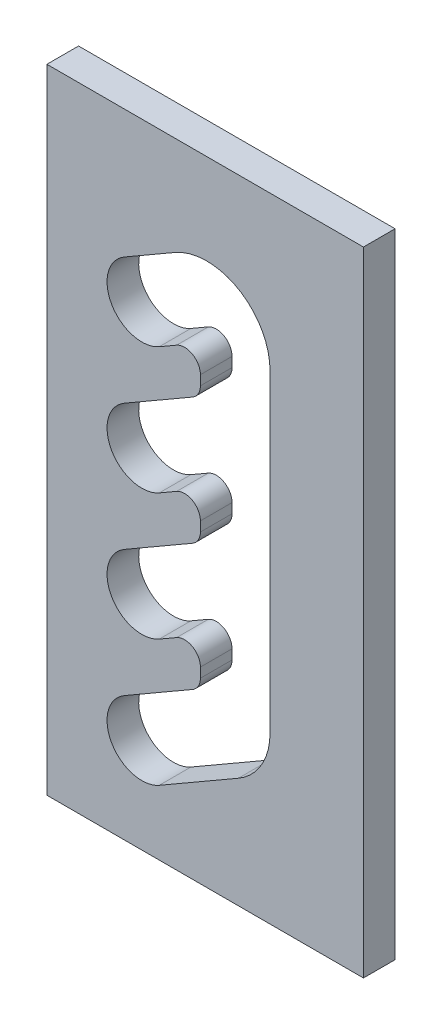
ISO-10303-21;
HEADER;
FILE_DESCRIPTION(('STEP AP214'),'2;1');
FILE_NAME('part.step','',(''),(''),'','','');
FILE_SCHEMA(('AUTOMOTIVE_DESIGN { 1 0 10303 214 1 1 1 1 }'));
ENDSEC;
DATA;
#1=APPLICATION_CONTEXT('core data for automotive mechanical design processes');
#2=APPLICATION_PROTOCOL_DEFINITION('international standard','automotive_design',2000,#1);
#3=PRODUCT_CONTEXT('',#1,'mechanical');
#4=PRODUCT('Part','Part','',(#3));
#5=PRODUCT_RELATED_PRODUCT_CATEGORY('part','',(#4));
#6=PRODUCT_DEFINITION_FORMATION('','',#4);
#7=PRODUCT_DEFINITION_CONTEXT('part definition',#1,'design');
#8=PRODUCT_DEFINITION('design','',#6,#7);
#9=PRODUCT_DEFINITION_SHAPE('','',#8);
#10=(LENGTH_UNIT() NAMED_UNIT(*) SI_UNIT(.MILLI.,.METRE.));
#11=(NAMED_UNIT(*) PLANE_ANGLE_UNIT() SI_UNIT($,.RADIAN.));
#12=(NAMED_UNIT(*) SI_UNIT($,.STERADIAN.) SOLID_ANGLE_UNIT());
#13=UNCERTAINTY_MEASURE_WITH_UNIT(LENGTH_MEASURE(1.E-05),#10,'distance_accuracy_value','');
#14=(GEOMETRIC_REPRESENTATION_CONTEXT(3) GLOBAL_UNCERTAINTY_ASSIGNED_CONTEXT((#13)) GLOBAL_UNIT_ASSIGNED_CONTEXT((#10,
#11,#12)) REPRESENTATION_CONTEXT('',''));
#15=CARTESIAN_POINT('',(0.,0.,0.));
#16=DIRECTION('',(0.,0.,1.));
#17=DIRECTION('',(1.,0.,0.));
#18=AXIS2_PLACEMENT_3D('',#15,#16,#17);
#19=CARTESIAN_POINT('',(0.,0.,10.));
#20=DIRECTION('',(1.,0.,0.));
#21=DIRECTION('',(0.,0.,-1.));
#22=AXIS2_PLACEMENT_3D('',#19,#20,#21);
#23=PLANE('',#22);
#24=DIRECTION('',(0.,-1.,0.));
#25=VECTOR('',#24,1.);
#26=CARTESIAN_POINT('',(0.,0.,0.));
#27=LINE('',#26,#25);
#28=CARTESIAN_POINT('',(0.,200.,0.));
#29=VERTEX_POINT('',#28);
#30=CARTESIAN_POINT('',(0.,0.,0.));
#31=VERTEX_POINT('',#30);
#32=EDGE_CURVE('E322',#29,#31,#27,.T.);
#33=ORIENTED_EDGE('',*,*,#32,.T.);
#34=DIRECTION('',(0.,0.,-1.));
#35=VECTOR('',#34,1.);
#36=CARTESIAN_POINT('',(0.,0.,10.));
#37=LINE('',#36,#35);
#38=CARTESIAN_POINT('',(0.,0.,10.));
#39=VERTEX_POINT('',#38);
#40=EDGE_CURVE('E363',#39,#31,#37,.T.);
#41=ORIENTED_EDGE('',*,*,#40,.F.);
#42=DIRECTION('',(0.,-1.,0.));
#43=VECTOR('',#42,1.);
#44=CARTESIAN_POINT('',(0.,0.,10.));
#45=LINE('',#44,#43);
#46=CARTESIAN_POINT('',(0.,200.,10.));
#47=VERTEX_POINT('',#46);
#48=EDGE_CURVE('E337',#47,#39,#45,.T.);
#49=ORIENTED_EDGE('',*,*,#48,.F.);
#50=DIRECTION('',(0.,0.,-1.));
#51=VECTOR('',#50,1.);
#52=CARTESIAN_POINT('',(0.,200.,10.));
#53=LINE('',#52,#51);
#54=EDGE_CURVE('E347',#47,#29,#53,.T.);
#55=ORIENTED_EDGE('',*,*,#54,.T.);
#56=EDGE_LOOP('',(#33,#41,#49,#55));
#57=FACE_BOUND('',#56,.T.);
#58=ADVANCED_FACE('F32',(#57),#23,.F.);
#59=CARTESIAN_POINT('',(0.,0.,10.));
#60=DIRECTION('',(0.,1.,0.));
#61=DIRECTION('',(0.,0.,1.));
#62=AXIS2_PLACEMENT_3D('',#59,#60,#61);
#63=PLANE('',#62);
#64=DIRECTION('',(1.,0.,0.));
#65=VECTOR('',#64,1.);
#66=CARTESIAN_POINT('',(0.,0.,0.));
#67=LINE('',#66,#65);
#68=CARTESIAN_POINT('',(100.,0.,0.));
#69=VERTEX_POINT('',#68);
#70=EDGE_CURVE('E350',#31,#69,#67,.T.);
#71=ORIENTED_EDGE('',*,*,#70,.T.);
#72=DIRECTION('',(0.,0.,-1.));
#73=VECTOR('',#72,1.);
#74=CARTESIAN_POINT('',(100.,0.,10.));
#75=LINE('',#74,#73);
#76=CARTESIAN_POINT('',(100.,0.,10.));
#77=VERTEX_POINT('',#76);
#78=EDGE_CURVE('E360',#77,#69,#75,.T.);
#79=ORIENTED_EDGE('',*,*,#78,.F.);
#80=DIRECTION('',(1.,0.,0.));
#81=VECTOR('',#80,1.);
#82=CARTESIAN_POINT('',(0.,0.,10.));
#83=LINE('',#82,#81);
#84=EDGE_CURVE('E340',#39,#77,#83,.T.);
#85=ORIENTED_EDGE('',*,*,#84,.F.);
#86=ORIENTED_EDGE('',*,*,#40,.T.);
#87=EDGE_LOOP('',(#71,#79,#85,#86));
#88=FACE_BOUND('',#87,.T.);
#89=ADVANCED_FACE('F530',(#88),#63,.F.);
#90=CARTESIAN_POINT('',(100.,0.,10.));
#91=DIRECTION('',(-1.,0.,0.));
#92=DIRECTION('',(0.,0.,1.));
#93=AXIS2_PLACEMENT_3D('',#90,#91,#92);
#94=PLANE('',#93);
#95=DIRECTION('',(0.,1.,0.));
#96=VECTOR('',#95,1.);
#97=CARTESIAN_POINT('',(100.,0.,0.));
#98=LINE('',#97,#96);
#99=CARTESIAN_POINT('',(100.,200.,0.));
#100=VERTEX_POINT('',#99);
#101=EDGE_CURVE('E352',#69,#100,#98,.T.);
#102=ORIENTED_EDGE('',*,*,#101,.T.);
#103=DIRECTION('',(0.,0.,-1.));
#104=VECTOR('',#103,1.);
#105=CARTESIAN_POINT('',(100.,200.,10.));
#106=LINE('',#105,#104);
#107=CARTESIAN_POINT('',(100.,200.,10.));
#108=VERTEX_POINT('',#107);
#109=EDGE_CURVE('E357',#108,#100,#106,.T.);
#110=ORIENTED_EDGE('',*,*,#109,.F.);
#111=DIRECTION('',(0.,1.,0.));
#112=VECTOR('',#111,1.);
#113=CARTESIAN_POINT('',(100.,0.,10.));
#114=LINE('',#113,#112);
#115=EDGE_CURVE('E343',#77,#108,#114,.T.);
#116=ORIENTED_EDGE('',*,*,#115,.F.);
#117=ORIENTED_EDGE('',*,*,#78,.T.);
#118=EDGE_LOOP('',(#102,#110,#116,#117));
#119=FACE_BOUND('',#118,.T.);
#120=ADVANCED_FACE('F536',(#119),#94,.F.);
#121=CARTESIAN_POINT('',(0.,200.,10.));
#122=DIRECTION('',(0.,-1.,0.));
#123=DIRECTION('',(0.,0.,-1.));
#124=AXIS2_PLACEMENT_3D('',#121,#122,#123);
#125=PLANE('',#124);
#126=DIRECTION('',(-1.,0.,0.));
#127=VECTOR('',#126,1.);
#128=CARTESIAN_POINT('',(0.,200.,0.));
#129=LINE('',#128,#127);
#130=EDGE_CURVE('E341',#100,#29,#129,.T.);
#131=ORIENTED_EDGE('',*,*,#130,.T.);
#132=ORIENTED_EDGE('',*,*,#54,.F.);
#133=DIRECTION('',(-1.,0.,0.));
#134=VECTOR('',#133,1.);
#135=CARTESIAN_POINT('',(0.,200.,10.));
#136=LINE('',#135,#134);
#137=EDGE_CURVE('E345',#108,#47,#136,.T.);
#138=ORIENTED_EDGE('',*,*,#137,.F.);
#139=ORIENTED_EDGE('',*,*,#109,.T.);
#140=EDGE_LOOP('',(#131,#132,#138,#139));
#141=FACE_BOUND('',#140,.T.);
#142=ADVANCED_FACE('F568',(#141),#125,.F.);
#143=CARTESIAN_POINT('',(0.,0.,10.));
#144=DIRECTION('',(0.,0.,-1.));
#145=DIRECTION('',(-1.,0.,0.));
#146=AXIS2_PLACEMENT_3D('',#143,#144,#145);
#147=PLANE('',#146);
#148=DIRECTION('',(-0.866025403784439,-0.499999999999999,0.));
#149=VECTOR('',#148,1.);
#150=CARTESIAN_POINT('',(24.5,39.5262794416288,10.));
#151=LINE('',#150,#149);
#152=CARTESIAN_POINT('',(45.9903810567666,51.9337567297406,10.));
#153=VERTEX_POINT('',#152);
#154=CARTESIAN_POINT('',(24.5,39.5262794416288,10.));
#155=VERTEX_POINT('',#154);
#156=EDGE_CURVE('E243',#153,#155,#151,.T.);
#157=ORIENTED_EDGE('',*,*,#156,.F.);
#158=CARTESIAN_POINT('',(43.4903810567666,56.2638837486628,10.));
#159=DIRECTION('',(0.,0.,-1.));
#160=DIRECTION('',(-1.,0.,0.));
#161=AXIS2_PLACEMENT_3D('',#158,#159,#160);
#162=CIRCLE('',#161,5.);
#163=CARTESIAN_POINT('',(48.4903810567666,56.2638837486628,10.));
#164=VERTEX_POINT('',#163);
#165=EDGE_CURVE('E379',#153,#164,#162,.F.);
#166=ORIENTED_EDGE('',*,*,#165,.T.);
#167=DIRECTION('',(0.,-1.,0.));
#168=VECTOR('',#167,1.);
#169=CARTESIAN_POINT('',(48.4903810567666,67.9737205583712,10.));
#170=LINE('',#169,#168);
#171=CARTESIAN_POINT('',(48.4903810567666,59.3134665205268,10.));
#172=VERTEX_POINT('',#171);
#173=EDGE_CURVE('E245',#172,#164,#170,.T.);
#174=ORIENTED_EDGE('',*,*,#173,.F.);
#175=CARTESIAN_POINT('',(43.4903810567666,59.3134665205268,10.));
#176=DIRECTION('',(0.,0.,-1.));
#177=DIRECTION('',(-1.,0.,0.));
#178=AXIS2_PLACEMENT_3D('',#175,#176,#177);
#179=CIRCLE('',#178,5.);
#180=CARTESIAN_POINT('',(40.9903810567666,63.643593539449,10.));
#181=VERTEX_POINT('',#180);
#182=EDGE_CURVE('E377',#172,#181,#179,.F.);
#183=ORIENTED_EDGE('',*,*,#182,.T.);
#184=DIRECTION('',(0.866025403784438,0.500000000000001,0.));
#185=VECTOR('',#184,1.);
#186=CARTESIAN_POINT('',(35.5,60.4737205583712,10.));
#187=LINE('',#186,#185);
#188=CARTESIAN_POINT('',(35.5,60.4737205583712,10.));
#189=VERTEX_POINT('',#188);
#190=EDGE_CURVE('E315',#189,#181,#187,.T.);
#191=ORIENTED_EDGE('',*,*,#190,.F.);
#192=CARTESIAN_POINT('',(30.,70.,10.));
#193=DIRECTION('',(0.,0.,1.));
#194=DIRECTION('',(1.,0.,0.));
#195=AXIS2_PLACEMENT_3D('',#192,#193,#194);
#196=CIRCLE('',#195,11.);
#197=CARTESIAN_POINT('',(24.5,79.5262794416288,10.));
#198=VERTEX_POINT('',#197);
#199=EDGE_CURVE('E312',#198,#189,#196,.T.);
#200=ORIENTED_EDGE('',*,*,#199,.F.);
#201=DIRECTION('',(-0.866025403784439,-0.5,0.));
#202=VECTOR('',#201,1.);
#203=CARTESIAN_POINT('',(24.5,79.5262794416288,10.));
#204=LINE('',#203,#202);
#205=CARTESIAN_POINT('',(45.9903810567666,91.9337567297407,10.));
#206=VERTEX_POINT('',#205);
#207=EDGE_CURVE('E310',#206,#198,#204,.T.);
#208=ORIENTED_EDGE('',*,*,#207,.F.);
#209=CARTESIAN_POINT('',(43.4903810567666,96.2638837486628,10.));
#210=DIRECTION('',(0.,0.,-1.));
#211=DIRECTION('',(-1.,0.,0.));
#212=AXIS2_PLACEMENT_3D('',#209,#210,#211);
#213=CIRCLE('',#212,5.);
#214=CARTESIAN_POINT('',(48.4903810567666,96.2638837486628,10.));
#215=VERTEX_POINT('',#214);
#216=EDGE_CURVE('E375',#206,#215,#213,.F.);
#217=ORIENTED_EDGE('',*,*,#216,.T.);
#218=DIRECTION('',(0.,-1.,0.));
#219=VECTOR('',#218,1.);
#220=CARTESIAN_POINT('',(48.4903810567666,107.973720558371,10.));
#221=LINE('',#220,#219);
#222=CARTESIAN_POINT('',(48.4903810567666,99.3134665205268,10.));
#223=VERTEX_POINT('',#222);
#224=EDGE_CURVE('E307',#223,#215,#221,.T.);
#225=ORIENTED_EDGE('',*,*,#224,.F.);
#226=CARTESIAN_POINT('',(43.4903810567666,99.3134665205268,10.));
#227=DIRECTION('',(0.,0.,-1.));
#228=DIRECTION('',(-1.,0.,0.));
#229=AXIS2_PLACEMENT_3D('',#226,#227,#228);
#230=CIRCLE('',#229,5.);
#231=CARTESIAN_POINT('',(40.9903810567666,103.643593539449,10.));
#232=VERTEX_POINT('',#231);
#233=EDGE_CURVE('E373',#223,#232,#230,.F.);
#234=ORIENTED_EDGE('',*,*,#233,.T.);
#235=DIRECTION('',(0.866025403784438,0.500000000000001,0.));
#236=VECTOR('',#235,1.);
#237=CARTESIAN_POINT('',(35.5,100.473720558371,10.));
#238=LINE('',#237,#236);
#239=CARTESIAN_POINT('',(35.5,100.473720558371,10.));
#240=VERTEX_POINT('',#239);
#241=EDGE_CURVE('E304',#240,#232,#238,.T.);
#242=ORIENTED_EDGE('',*,*,#241,.F.);
#243=CARTESIAN_POINT('',(30.,110.,10.));
#244=DIRECTION('',(0.,0.,1.));
#245=DIRECTION('',(1.,0.,0.));
#246=AXIS2_PLACEMENT_3D('',#243,#244,#245);
#247=CIRCLE('',#246,11.);
#248=CARTESIAN_POINT('',(24.5,119.526279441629,10.));
#249=VERTEX_POINT('',#248);
#250=EDGE_CURVE('E301',#249,#240,#247,.T.);
#251=ORIENTED_EDGE('',*,*,#250,.F.);
#252=DIRECTION('',(-0.866025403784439,-0.5,0.));
#253=VECTOR('',#252,1.);
#254=CARTESIAN_POINT('',(24.5,119.526279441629,10.));
#255=LINE('',#254,#253);
#256=CARTESIAN_POINT('',(45.9903810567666,131.933756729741,10.));
#257=VERTEX_POINT('',#256);
#258=EDGE_CURVE('E299',#257,#249,#255,.T.);
#259=ORIENTED_EDGE('',*,*,#258,.F.);
#260=CARTESIAN_POINT('',(43.4903810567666,136.263883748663,10.));
#261=DIRECTION('',(0.,0.,-1.));
#262=DIRECTION('',(-1.,0.,0.));
#263=AXIS2_PLACEMENT_3D('',#260,#261,#262);
#264=CIRCLE('',#263,5.);
#265=CARTESIAN_POINT('',(48.4903810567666,136.263883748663,10.));
#266=VERTEX_POINT('',#265);
#267=EDGE_CURVE('E371',#257,#266,#264,.F.);
#268=ORIENTED_EDGE('',*,*,#267,.T.);
#269=DIRECTION('',(0.,-1.,0.));
#270=VECTOR('',#269,1.);
#271=CARTESIAN_POINT('',(48.4903810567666,147.973720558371,10.));
#272=LINE('',#271,#270);
#273=CARTESIAN_POINT('',(48.4903810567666,139.313466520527,10.));
#274=VERTEX_POINT('',#273);
#275=EDGE_CURVE('E296',#274,#266,#272,.T.);
#276=ORIENTED_EDGE('',*,*,#275,.F.);
#277=CARTESIAN_POINT('',(43.4903810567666,139.313466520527,10.));
#278=DIRECTION('',(0.,0.,-1.));
#279=DIRECTION('',(-1.,0.,0.));
#280=AXIS2_PLACEMENT_3D('',#277,#278,#279);
#281=CIRCLE('',#280,5.);
#282=CARTESIAN_POINT('',(40.9903810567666,143.643593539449,10.));
#283=VERTEX_POINT('',#282);
#284=EDGE_CURVE('E369',#274,#283,#281,.F.);
#285=ORIENTED_EDGE('',*,*,#284,.T.);
#286=DIRECTION('',(0.866025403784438,0.500000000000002,0.));
#287=VECTOR('',#286,1.);
#288=CARTESIAN_POINT('',(35.5,140.473720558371,10.));
#289=LINE('',#288,#287);
#290=CARTESIAN_POINT('',(35.5,140.473720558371,10.));
#291=VERTEX_POINT('',#290);
#292=EDGE_CURVE('E293',#291,#283,#289,.T.);
#293=ORIENTED_EDGE('',*,*,#292,.F.);
#294=CARTESIAN_POINT('',(30.,150.,10.));
#295=DIRECTION('',(0.,0.,1.));
#296=DIRECTION('',(1.,0.,0.));
#297=AXIS2_PLACEMENT_3D('',#294,#295,#296);
#298=CIRCLE('',#297,11.);
#299=CARTESIAN_POINT('',(24.5,159.526279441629,10.));
#300=VERTEX_POINT('',#299);
#301=EDGE_CURVE('E290',#300,#291,#298,.T.);
#302=ORIENTED_EDGE('',*,*,#301,.F.);
#303=DIRECTION('',(-0.866025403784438,-0.500000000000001,0.));
#304=VECTOR('',#303,1.);
#305=CARTESIAN_POINT('',(24.5,159.526279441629,10.));
#306=LINE('',#305,#304);
#307=CARTESIAN_POINT('',(40.4903810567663,168.758330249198,10.));
#308=VERTEX_POINT('',#307);
#309=EDGE_CURVE('E288',#308,#300,#306,.T.);
#310=ORIENTED_EDGE('',*,*,#309,.F.);
#311=CARTESIAN_POINT('',(50.4903810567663,151.437822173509,10.));
#312=DIRECTION('',(0.,0.,-1.));
#313=DIRECTION('',(-1.,0.,0.));
#314=AXIS2_PLACEMENT_3D('',#311,#312,#313);
#315=CIRCLE('',#314,20.);
#316=CARTESIAN_POINT('',(70.4903810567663,151.437822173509,10.));
#317=VERTEX_POINT('',#316);
#318=EDGE_CURVE('E40',#308,#317,#315,.T.);
#319=ORIENTED_EDGE('',*,*,#318,.T.);
#320=DIRECTION('',(0.,1.,0.));
#321=VECTOR('',#320,1.);
#322=CARTESIAN_POINT('',(70.4903810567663,186.078838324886,10.));
#323=LINE('',#322,#321);
#324=CARTESIAN_POINT('',(70.4903810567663,52.2224318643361,10.));
#325=VERTEX_POINT('',#324);
#326=EDGE_CURVE('E285',#325,#317,#323,.T.);
#327=ORIENTED_EDGE('',*,*,#326,.F.);
#328=CARTESIAN_POINT('',(50.4903810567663,52.2224318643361,10.));
#329=DIRECTION('',(0.,0.,-1.));
#330=DIRECTION('',(-1.,0.,0.));
#331=AXIS2_PLACEMENT_3D('',#328,#329,#330);
#332=CIRCLE('',#331,20.);
#333=CARTESIAN_POINT('',(60.4903810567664,34.9019237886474,10.));
#334=VERTEX_POINT('',#333);
#335=EDGE_CURVE('E428',#325,#334,#332,.T.);
#336=ORIENTED_EDGE('',*,*,#335,.T.);
#337=DIRECTION('',(0.866025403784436,0.500000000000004,0.));
#338=VECTOR('',#337,1.);
#339=CARTESIAN_POINT('',(48.4903810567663,27.9737205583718,10.));
#340=LINE('',#339,#338);
#341=CARTESIAN_POINT('',(35.4999999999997,20.4737205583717,10.));
#342=VERTEX_POINT('',#341);
#343=EDGE_CURVE('E283',#342,#334,#340,.T.);
#344=ORIENTED_EDGE('',*,*,#343,.F.);
#345=CARTESIAN_POINT('',(30.,30.,10.));
#346=DIRECTION('',(0.,0.,1.));
#347=DIRECTION('',(1.,0.,0.));
#348=AXIS2_PLACEMENT_3D('',#345,#346,#347);
#349=CIRCLE('',#348,10.9999999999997);
#350=EDGE_CURVE('E223',#155,#342,#349,.T.);
#351=ORIENTED_EDGE('',*,*,#350,.F.);
#352=EDGE_LOOP('',(#157,#166,#174,#183,#191,#200,#208,#217,#225,#234,#242,#251,#259,#268,#276,
#285,#293,#302,#310,#319,#327,#336,#344,#351));
#353=FACE_BOUND('',#352,.T.);
#354=ORIENTED_EDGE('',*,*,#48,.T.);
#355=ORIENTED_EDGE('',*,*,#84,.T.);
#356=ORIENTED_EDGE('',*,*,#115,.T.);
#357=ORIENTED_EDGE('',*,*,#137,.T.);
#358=EDGE_LOOP('',(#354,#355,#356,#357));
#359=FACE_BOUND('',#358,.T.);
#360=ADVANCED_FACE('F435',(#353,#359),#147,.F.);
#361=CARTESIAN_POINT('',(0.,0.,0.));
#362=DIRECTION('',(0.,0.,-1.));
#363=DIRECTION('',(-1.,0.,0.));
#364=AXIS2_PLACEMENT_3D('',#361,#362,#363);
#365=PLANE('',#364);
#366=DIRECTION('',(0.,-1.,0.));
#367=VECTOR('',#366,1.);
#368=CARTESIAN_POINT('',(48.4903810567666,67.9737205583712,0.));
#369=LINE('',#368,#367);
#370=CARTESIAN_POINT('',(48.4903810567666,59.3134665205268,0.));
#371=VERTEX_POINT('',#370);
#372=CARTESIAN_POINT('',(48.4903810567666,56.2638837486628,0.));
#373=VERTEX_POINT('',#372);
#374=EDGE_CURVE('E279',#371,#373,#369,.T.);
#375=ORIENTED_EDGE('',*,*,#374,.T.);
#376=CARTESIAN_POINT('',(43.4903810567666,56.2638837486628,0.));
#377=DIRECTION('',(0.,0.,-1.));
#378=DIRECTION('',(-1.,0.,0.));
#379=AXIS2_PLACEMENT_3D('',#376,#377,#378);
#380=CIRCLE('',#379,5.);
#381=CARTESIAN_POINT('',(45.9903810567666,51.9337567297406,0.));
#382=VERTEX_POINT('',#381);
#383=EDGE_CURVE('E396',#373,#382,#380,.T.);
#384=ORIENTED_EDGE('',*,*,#383,.T.);
#385=DIRECTION('',(-0.866025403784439,-0.499999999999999,0.));
#386=VECTOR('',#385,1.);
#387=CARTESIAN_POINT('',(24.5,39.5262794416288,0.));
#388=LINE('',#387,#386);
#389=CARTESIAN_POINT('',(24.5,39.5262794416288,0.));
#390=VERTEX_POINT('',#389);
#391=EDGE_CURVE('E228',#382,#390,#388,.T.);
#392=ORIENTED_EDGE('',*,*,#391,.T.);
#393=CARTESIAN_POINT('',(30.,30.,0.));
#394=DIRECTION('',(0.,0.,1.));
#395=DIRECTION('',(1.,0.,0.));
#396=AXIS2_PLACEMENT_3D('',#393,#394,#395);
#397=CIRCLE('',#396,10.9999999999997);
#398=CARTESIAN_POINT('',(35.4999999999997,20.4737205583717,0.));
#399=VERTEX_POINT('',#398);
#400=EDGE_CURVE('E221',#390,#399,#397,.T.);
#401=ORIENTED_EDGE('',*,*,#400,.T.);
#402=DIRECTION('',(0.866025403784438,0.500000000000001,0.));
#403=VECTOR('',#402,1.);
#404=CARTESIAN_POINT('',(35.4999999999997,20.4737205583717,0.));
#405=LINE('',#404,#403);
#406=CARTESIAN_POINT('',(60.4903810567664,34.9019237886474,0.));
#407=VERTEX_POINT('',#406);
#408=EDGE_CURVE('E231',#399,#407,#405,.T.);
#409=ORIENTED_EDGE('',*,*,#408,.T.);
#410=CARTESIAN_POINT('',(50.4903810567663,52.2224318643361,0.));
#411=DIRECTION('',(0.,0.,-1.));
#412=DIRECTION('',(-1.,0.,0.));
#413=AXIS2_PLACEMENT_3D('',#410,#411,#412);
#414=CIRCLE('',#413,20.);
#415=CARTESIAN_POINT('',(70.4903810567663,52.2224318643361,0.));
#416=VERTEX_POINT('',#415);
#417=EDGE_CURVE('E430',#407,#416,#414,.F.);
#418=ORIENTED_EDGE('',*,*,#417,.T.);
#419=DIRECTION('',(0.,1.,0.));
#420=VECTOR('',#419,1.);
#421=CARTESIAN_POINT('',(70.4903810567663,186.078838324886,0.));
#422=LINE('',#421,#420);
#423=CARTESIAN_POINT('',(70.4903810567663,151.437822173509,0.));
#424=VERTEX_POINT('',#423);
#425=EDGE_CURVE('E236',#416,#424,#422,.T.);
#426=ORIENTED_EDGE('',*,*,#425,.T.);
#427=CARTESIAN_POINT('',(50.4903810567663,151.437822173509,0.));
#428=DIRECTION('',(0.,0.,-1.));
#429=DIRECTION('',(-1.,0.,0.));
#430=AXIS2_PLACEMENT_3D('',#427,#428,#429);
#431=CIRCLE('',#430,20.);
#432=CARTESIAN_POINT('',(40.4903810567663,168.758330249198,0.));
#433=VERTEX_POINT('',#432);
#434=EDGE_CURVE('E11',#424,#433,#431,.F.);
#435=ORIENTED_EDGE('',*,*,#434,.T.);
#436=DIRECTION('',(-0.866025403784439,-0.5,0.));
#437=VECTOR('',#436,1.);
#438=CARTESIAN_POINT('',(48.4903810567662,173.377132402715,0.));
#439=LINE('',#438,#437);
#440=CARTESIAN_POINT('',(24.5,159.526279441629,0.));
#441=VERTEX_POINT('',#440);
#442=EDGE_CURVE('E249',#433,#441,#439,.T.);
#443=ORIENTED_EDGE('',*,*,#442,.T.);
#444=CARTESIAN_POINT('',(30.,150.,0.));
#445=DIRECTION('',(0.,0.,1.));
#446=DIRECTION('',(1.,0.,0.));
#447=AXIS2_PLACEMENT_3D('',#444,#445,#446);
#448=CIRCLE('',#447,11.);
#449=CARTESIAN_POINT('',(35.5,140.473720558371,0.));
#450=VERTEX_POINT('',#449);
#451=EDGE_CURVE('E251',#441,#450,#448,.T.);
#452=ORIENTED_EDGE('',*,*,#451,.T.);
#453=DIRECTION('',(0.866025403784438,0.500000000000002,0.));
#454=VECTOR('',#453,1.);
#455=CARTESIAN_POINT('',(35.5,140.473720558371,0.));
#456=LINE('',#455,#454);
#457=CARTESIAN_POINT('',(40.9903810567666,143.643593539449,0.));
#458=VERTEX_POINT('',#457);
#459=EDGE_CURVE('E254',#450,#458,#456,.T.);
#460=ORIENTED_EDGE('',*,*,#459,.T.);
#461=CARTESIAN_POINT('',(43.4903810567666,139.313466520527,0.));
#462=DIRECTION('',(0.,0.,-1.));
#463=DIRECTION('',(-1.,0.,0.));
#464=AXIS2_PLACEMENT_3D('',#461,#462,#463);
#465=CIRCLE('',#464,5.);
#466=CARTESIAN_POINT('',(48.4903810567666,139.313466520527,0.));
#467=VERTEX_POINT('',#466);
#468=EDGE_CURVE('E386',#458,#467,#465,.T.);
#469=ORIENTED_EDGE('',*,*,#468,.T.);
#470=DIRECTION('',(0.,-1.,0.));
#471=VECTOR('',#470,1.);
#472=CARTESIAN_POINT('',(48.4903810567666,147.973720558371,0.));
#473=LINE('',#472,#471);
#474=CARTESIAN_POINT('',(48.4903810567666,136.263883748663,0.));
#475=VERTEX_POINT('',#474);
#476=EDGE_CURVE('E257',#467,#475,#473,.T.);
#477=ORIENTED_EDGE('',*,*,#476,.T.);
#478=CARTESIAN_POINT('',(43.4903810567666,136.263883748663,0.));
#479=DIRECTION('',(0.,0.,-1.));
#480=DIRECTION('',(-1.,0.,0.));
#481=AXIS2_PLACEMENT_3D('',#478,#479,#480);
#482=CIRCLE('',#481,5.);
#483=CARTESIAN_POINT('',(45.9903810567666,131.933756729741,0.));
#484=VERTEX_POINT('',#483);
#485=EDGE_CURVE('E388',#475,#484,#482,.T.);
#486=ORIENTED_EDGE('',*,*,#485,.T.);
#487=DIRECTION('',(-0.866025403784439,-0.5,0.));
#488=VECTOR('',#487,1.);
#489=CARTESIAN_POINT('',(24.5,119.526279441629,0.));
#490=LINE('',#489,#488);
#491=CARTESIAN_POINT('',(24.5,119.526279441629,0.));
#492=VERTEX_POINT('',#491);
#493=EDGE_CURVE('E260',#484,#492,#490,.T.);
#494=ORIENTED_EDGE('',*,*,#493,.T.);
#495=CARTESIAN_POINT('',(30.,110.,0.));
#496=DIRECTION('',(0.,0.,1.));
#497=DIRECTION('',(1.,0.,0.));
#498=AXIS2_PLACEMENT_3D('',#495,#496,#497);
#499=CIRCLE('',#498,11.);
#500=CARTESIAN_POINT('',(35.5,100.473720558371,0.));
#501=VERTEX_POINT('',#500);
#502=EDGE_CURVE('E262',#492,#501,#499,.T.);
#503=ORIENTED_EDGE('',*,*,#502,.T.);
#504=DIRECTION('',(0.866025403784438,0.500000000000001,0.));
#505=VECTOR('',#504,1.);
#506=CARTESIAN_POINT('',(35.5,100.473720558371,0.));
#507=LINE('',#506,#505);
#508=CARTESIAN_POINT('',(40.9903810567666,103.643593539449,0.));
#509=VERTEX_POINT('',#508);
#510=EDGE_CURVE('E265',#501,#509,#507,.T.);
#511=ORIENTED_EDGE('',*,*,#510,.T.);
#512=CARTESIAN_POINT('',(43.4903810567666,99.3134665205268,0.));
#513=DIRECTION('',(0.,0.,-1.));
#514=DIRECTION('',(-1.,0.,0.));
#515=AXIS2_PLACEMENT_3D('',#512,#513,#514);
#516=CIRCLE('',#515,5.);
#517=CARTESIAN_POINT('',(48.4903810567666,99.3134665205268,0.));
#518=VERTEX_POINT('',#517);
#519=EDGE_CURVE('E390',#509,#518,#516,.T.);
#520=ORIENTED_EDGE('',*,*,#519,.T.);
#521=DIRECTION('',(0.,-1.,0.));
#522=VECTOR('',#521,1.);
#523=CARTESIAN_POINT('',(48.4903810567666,107.973720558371,0.));
#524=LINE('',#523,#522);
#525=CARTESIAN_POINT('',(48.4903810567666,96.2638837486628,0.));
#526=VERTEX_POINT('',#525);
#527=EDGE_CURVE('E268',#518,#526,#524,.T.);
#528=ORIENTED_EDGE('',*,*,#527,.T.);
#529=CARTESIAN_POINT('',(43.4903810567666,96.2638837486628,0.));
#530=DIRECTION('',(0.,0.,-1.));
#531=DIRECTION('',(-1.,0.,0.));
#532=AXIS2_PLACEMENT_3D('',#529,#530,#531);
#533=CIRCLE('',#532,5.);
#534=CARTESIAN_POINT('',(45.9903810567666,91.9337567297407,0.));
#535=VERTEX_POINT('',#534);
#536=EDGE_CURVE('E392',#526,#535,#533,.T.);
#537=ORIENTED_EDGE('',*,*,#536,.T.);
#538=DIRECTION('',(-0.866025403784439,-0.5,0.));
#539=VECTOR('',#538,1.);
#540=CARTESIAN_POINT('',(24.5,79.5262794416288,0.));
#541=LINE('',#540,#539);
#542=CARTESIAN_POINT('',(24.5,79.5262794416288,0.));
#543=VERTEX_POINT('',#542);
#544=EDGE_CURVE('E271',#535,#543,#541,.T.);
#545=ORIENTED_EDGE('',*,*,#544,.T.);
#546=CARTESIAN_POINT('',(30.,70.,0.));
#547=DIRECTION('',(0.,0.,1.));
#548=DIRECTION('',(1.,0.,0.));
#549=AXIS2_PLACEMENT_3D('',#546,#547,#548);
#550=CIRCLE('',#549,11.);
#551=CARTESIAN_POINT('',(35.5,60.4737205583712,0.));
#552=VERTEX_POINT('',#551);
#553=EDGE_CURVE('E273',#543,#552,#550,.T.);
#554=ORIENTED_EDGE('',*,*,#553,.T.);
#555=DIRECTION('',(0.866025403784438,0.500000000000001,0.));
#556=VECTOR('',#555,1.);
#557=CARTESIAN_POINT('',(35.5,60.4737205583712,0.));
#558=LINE('',#557,#556);
#559=CARTESIAN_POINT('',(40.9903810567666,63.643593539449,0.));
#560=VERTEX_POINT('',#559);
#561=EDGE_CURVE('E276',#552,#560,#558,.T.);
#562=ORIENTED_EDGE('',*,*,#561,.T.);
#563=CARTESIAN_POINT('',(43.4903810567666,59.3134665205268,0.));
#564=DIRECTION('',(0.,0.,-1.));
#565=DIRECTION('',(-1.,0.,0.));
#566=AXIS2_PLACEMENT_3D('',#563,#564,#565);
#567=CIRCLE('',#566,5.);
#568=EDGE_CURVE('E394',#560,#371,#567,.T.);
#569=ORIENTED_EDGE('',*,*,#568,.T.);
#570=EDGE_LOOP('',(#375,#384,#392,#401,#409,#418,#426,#435,#443,#452,#460,#469,#477,#486,#494,
#503,#511,#520,#528,#537,#545,#554,#562,#569));
#571=FACE_BOUND('',#570,.T.);
#572=ORIENTED_EDGE('',*,*,#32,.F.);
#573=ORIENTED_EDGE('',*,*,#130,.F.);
#574=ORIENTED_EDGE('',*,*,#101,.F.);
#575=ORIENTED_EDGE('',*,*,#70,.F.);
#576=EDGE_LOOP('',(#572,#573,#574,#575));
#577=FACE_BOUND('',#576,.T.);
#578=ADVANCED_FACE('F239',(#571,#577),#365,.T.);
#579=CARTESIAN_POINT('',(30.,30.,0.));
#580=DIRECTION('',(0.,0.,1.));
#581=DIRECTION('',(1.,0.,0.));
#582=AXIS2_PLACEMENT_3D('',#579,#580,#581);
#583=CYLINDRICAL_SURFACE('',#582,10.9999999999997);
#584=ORIENTED_EDGE('',*,*,#350,.T.);
#585=DIRECTION('',(0.,0.,1.));
#586=VECTOR('',#585,1.);
#587=CARTESIAN_POINT('',(35.4999999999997,20.4737205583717,0.));
#588=LINE('',#587,#586);
#589=EDGE_CURVE('E216',#399,#342,#588,.T.);
#590=ORIENTED_EDGE('',*,*,#589,.F.);
#591=ORIENTED_EDGE('',*,*,#400,.F.);
#592=DIRECTION('',(0.,0.,1.));
#593=VECTOR('',#592,1.);
#594=CARTESIAN_POINT('',(24.5,39.5262794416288,0.));
#595=LINE('',#594,#593);
#596=EDGE_CURVE('E320',#390,#155,#595,.T.);
#597=ORIENTED_EDGE('',*,*,#596,.T.);
#598=EDGE_LOOP('',(#584,#590,#591,#597));
#599=FACE_BOUND('',#598,.T.);
#600=ADVANCED_FACE('F218',(#599),#583,.F.);
#601=CARTESIAN_POINT('',(24.5,39.5262794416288,0.));
#602=DIRECTION('',(-0.5,0.866025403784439,0.));
#603=DIRECTION('',(-0.866025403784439,-0.5,0.));
#604=AXIS2_PLACEMENT_3D('',#601,#602,#603);
#605=PLANE('',#604);
#606=ORIENTED_EDGE('',*,*,#391,.F.);
#607=DIRECTION('',(0.,0.,1.));
#608=VECTOR('',#607,1.);
#609=CARTESIAN_POINT('',(45.9903810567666,51.9337567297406,0.));
#610=LINE('',#609,#608);
#611=EDGE_CURVE('E366',#382,#153,#610,.T.);
#612=ORIENTED_EDGE('',*,*,#611,.T.);
#613=ORIENTED_EDGE('',*,*,#156,.T.);
#614=ORIENTED_EDGE('',*,*,#596,.F.);
#615=EDGE_LOOP('',(#606,#612,#613,#614));
#616=FACE_BOUND('',#615,.T.);
#617=ADVANCED_FACE('F520',(#616),#605,.F.);
#618=CARTESIAN_POINT('',(48.4903810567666,67.9737205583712,0.));
#619=DIRECTION('',(-1.,0.,0.));
#620=DIRECTION('',(0.,-1.,0.));
#621=AXIS2_PLACEMENT_3D('',#618,#619,#620);
#622=PLANE('',#621);
#623=ORIENTED_EDGE('',*,*,#173,.T.);
#624=DIRECTION('',(0.,0.,1.));
#625=VECTOR('',#624,1.);
#626=CARTESIAN_POINT('',(48.4903810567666,56.2638837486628,0.));
#627=LINE('',#626,#625);
#628=EDGE_CURVE('E384',#164,#373,#627,.F.);
#629=ORIENTED_EDGE('',*,*,#628,.T.);
#630=ORIENTED_EDGE('',*,*,#374,.F.);
#631=DIRECTION('',(0.,0.,1.));
#632=VECTOR('',#631,1.);
#633=CARTESIAN_POINT('',(48.4903810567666,59.3134665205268,0.));
#634=LINE('',#633,#632);
#635=EDGE_CURVE('E381',#371,#172,#634,.T.);
#636=ORIENTED_EDGE('',*,*,#635,.T.);
#637=EDGE_LOOP('',(#623,#629,#630,#636));
#638=FACE_BOUND('',#637,.T.);
#639=ADVANCED_FACE('F513',(#638),#622,.F.);
#640=CARTESIAN_POINT('',(35.5,60.4737205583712,0.));
#641=DIRECTION('',(0.500000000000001,-0.866025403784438,0.));
#642=DIRECTION('',(0.866025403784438,0.500000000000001,0.));
#643=AXIS2_PLACEMENT_3D('',#640,#641,#642);
#644=PLANE('',#643);
#645=ORIENTED_EDGE('',*,*,#190,.T.);
#646=DIRECTION('',(0.,0.,1.));
#647=VECTOR('',#646,1.);
#648=CARTESIAN_POINT('',(40.9903810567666,63.643593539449,0.));
#649=LINE('',#648,#647);
#650=EDGE_CURVE('E398',#181,#560,#649,.F.);
#651=ORIENTED_EDGE('',*,*,#650,.T.);
#652=ORIENTED_EDGE('',*,*,#561,.F.);
#653=DIRECTION('',(0.,0.,1.));
#654=VECTOR('',#653,1.);
#655=CARTESIAN_POINT('',(35.5,60.4737205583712,0.));
#656=LINE('',#655,#654);
#657=EDGE_CURVE('E323',#552,#189,#656,.T.);
#658=ORIENTED_EDGE('',*,*,#657,.T.);
#659=EDGE_LOOP('',(#645,#651,#652,#658));
#660=FACE_BOUND('',#659,.T.);
#661=ADVANCED_FACE('F505',(#660),#644,.F.);
#662=CARTESIAN_POINT('',(30.,70.,0.));
#663=DIRECTION('',(0.,0.,1.));
#664=DIRECTION('',(1.,0.,0.));
#665=AXIS2_PLACEMENT_3D('',#662,#663,#664);
#666=CYLINDRICAL_SURFACE('',#665,11.);
#667=ORIENTED_EDGE('',*,*,#199,.T.);
#668=ORIENTED_EDGE('',*,*,#657,.F.);
#669=ORIENTED_EDGE('',*,*,#553,.F.);
#670=DIRECTION('',(0.,0.,1.));
#671=VECTOR('',#670,1.);
#672=CARTESIAN_POINT('',(24.5,79.5262794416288,0.));
#673=LINE('',#672,#671);
#674=EDGE_CURVE('E325',#543,#198,#673,.T.);
#675=ORIENTED_EDGE('',*,*,#674,.T.);
#676=EDGE_LOOP('',(#667,#668,#669,#675));
#677=FACE_BOUND('',#676,.T.);
#678=ADVANCED_FACE('F502',(#677),#666,.F.);
#679=CARTESIAN_POINT('',(24.5,79.5262794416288,0.));
#680=DIRECTION('',(-0.5,0.866025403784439,0.));
#681=DIRECTION('',(-0.866025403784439,-0.5,0.));
#682=AXIS2_PLACEMENT_3D('',#679,#680,#681);
#683=PLANE('',#682);
#684=ORIENTED_EDGE('',*,*,#544,.F.);
#685=DIRECTION('',(0.,0.,1.));
#686=VECTOR('',#685,1.);
#687=CARTESIAN_POINT('',(45.9903810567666,91.9337567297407,0.));
#688=LINE('',#687,#686);
#689=EDGE_CURVE('E400',#535,#206,#688,.T.);
#690=ORIENTED_EDGE('',*,*,#689,.T.);
#691=ORIENTED_EDGE('',*,*,#207,.T.);
#692=ORIENTED_EDGE('',*,*,#674,.F.);
#693=EDGE_LOOP('',(#684,#690,#691,#692));
#694=FACE_BOUND('',#693,.T.);
#695=ADVANCED_FACE('F496',(#694),#683,.F.);
#696=CARTESIAN_POINT('',(48.4903810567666,107.973720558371,0.));
#697=DIRECTION('',(-1.,0.,0.));
#698=DIRECTION('',(0.,0.,1.));
#699=AXIS2_PLACEMENT_3D('',#696,#697,#698);
#700=PLANE('',#699);
#701=ORIENTED_EDGE('',*,*,#224,.T.);
#702=DIRECTION('',(0.,0.,1.));
#703=VECTOR('',#702,1.);
#704=CARTESIAN_POINT('',(48.4903810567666,96.2638837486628,0.));
#705=LINE('',#704,#703);
#706=EDGE_CURVE('E406',#215,#526,#705,.F.);
#707=ORIENTED_EDGE('',*,*,#706,.T.);
#708=ORIENTED_EDGE('',*,*,#527,.F.);
#709=DIRECTION('',(0.,0.,1.));
#710=VECTOR('',#709,1.);
#711=CARTESIAN_POINT('',(48.4903810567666,99.3134665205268,0.));
#712=LINE('',#711,#710);
#713=EDGE_CURVE('E403',#518,#223,#712,.T.);
#714=ORIENTED_EDGE('',*,*,#713,.T.);
#715=EDGE_LOOP('',(#701,#707,#708,#714));
#716=FACE_BOUND('',#715,.T.);
#717=ADVANCED_FACE('F485',(#716),#700,.F.);
#718=CARTESIAN_POINT('',(35.5,100.473720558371,0.));
#719=DIRECTION('',(0.500000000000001,-0.866025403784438,0.));
#720=DIRECTION('',(0.866025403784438,0.500000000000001,0.));
#721=AXIS2_PLACEMENT_3D('',#718,#719,#720);
#722=PLANE('',#721);
#723=ORIENTED_EDGE('',*,*,#241,.T.);
#724=DIRECTION('',(0.,0.,1.));
#725=VECTOR('',#724,1.);
#726=CARTESIAN_POINT('',(40.9903810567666,103.643593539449,0.));
#727=LINE('',#726,#725);
#728=EDGE_CURVE('E408',#232,#509,#727,.F.);
#729=ORIENTED_EDGE('',*,*,#728,.T.);
#730=ORIENTED_EDGE('',*,*,#510,.F.);
#731=DIRECTION('',(0.,0.,1.));
#732=VECTOR('',#731,1.);
#733=CARTESIAN_POINT('',(35.5,100.473720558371,0.));
#734=LINE('',#733,#732);
#735=EDGE_CURVE('E328',#501,#240,#734,.T.);
#736=ORIENTED_EDGE('',*,*,#735,.T.);
#737=EDGE_LOOP('',(#723,#729,#730,#736));
#738=FACE_BOUND('',#737,.T.);
#739=ADVANCED_FACE('F672',(#738),#722,.F.);
#740=CARTESIAN_POINT('',(30.,110.,0.));
#741=DIRECTION('',(0.,0.,1.));
#742=DIRECTION('',(1.,0.,0.));
#743=AXIS2_PLACEMENT_3D('',#740,#741,#742);
#744=CYLINDRICAL_SURFACE('',#743,11.);
#745=ORIENTED_EDGE('',*,*,#250,.T.);
#746=ORIENTED_EDGE('',*,*,#735,.F.);
#747=ORIENTED_EDGE('',*,*,#502,.F.);
#748=DIRECTION('',(0.,0.,1.));
#749=VECTOR('',#748,1.);
#750=CARTESIAN_POINT('',(24.5,119.526279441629,0.));
#751=LINE('',#750,#749);
#752=EDGE_CURVE('E330',#492,#249,#751,.T.);
#753=ORIENTED_EDGE('',*,*,#752,.T.);
#754=EDGE_LOOP('',(#745,#746,#747,#753));
#755=FACE_BOUND('',#754,.T.);
#756=ADVANCED_FACE('F474',(#755),#744,.F.);
#757=CARTESIAN_POINT('',(24.5,119.526279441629,0.));
#758=DIRECTION('',(-0.5,0.866025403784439,0.));
#759=DIRECTION('',(-0.866025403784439,-0.5,0.));
#760=AXIS2_PLACEMENT_3D('',#757,#758,#759);
#761=PLANE('',#760);
#762=ORIENTED_EDGE('',*,*,#493,.F.);
#763=DIRECTION('',(0.,0.,1.));
#764=VECTOR('',#763,1.);
#765=CARTESIAN_POINT('',(45.9903810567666,131.933756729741,0.));
#766=LINE('',#765,#764);
#767=EDGE_CURVE('E410',#484,#257,#766,.T.);
#768=ORIENTED_EDGE('',*,*,#767,.T.);
#769=ORIENTED_EDGE('',*,*,#258,.T.);
#770=ORIENTED_EDGE('',*,*,#752,.F.);
#771=EDGE_LOOP('',(#762,#768,#769,#770));
#772=FACE_BOUND('',#771,.T.);
#773=ADVANCED_FACE('F469',(#772),#761,.F.);
#774=CARTESIAN_POINT('',(48.4903810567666,147.973720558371,0.));
#775=DIRECTION('',(-1.,0.,0.));
#776=DIRECTION('',(0.,0.,1.));
#777=AXIS2_PLACEMENT_3D('',#774,#775,#776);
#778=PLANE('',#777);
#779=ORIENTED_EDGE('',*,*,#275,.T.);
#780=DIRECTION('',(0.,0.,1.));
#781=VECTOR('',#780,1.);
#782=CARTESIAN_POINT('',(48.4903810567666,136.263883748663,0.));
#783=LINE('',#782,#781);
#784=EDGE_CURVE('E416',#266,#475,#783,.F.);
#785=ORIENTED_EDGE('',*,*,#784,.T.);
#786=ORIENTED_EDGE('',*,*,#476,.F.);
#787=DIRECTION('',(0.,0.,1.));
#788=VECTOR('',#787,1.);
#789=CARTESIAN_POINT('',(48.4903810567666,139.313466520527,0.));
#790=LINE('',#789,#788);
#791=EDGE_CURVE('E413',#467,#274,#790,.T.);
#792=ORIENTED_EDGE('',*,*,#791,.T.);
#793=EDGE_LOOP('',(#779,#785,#786,#792));
#794=FACE_BOUND('',#793,.T.);
#795=ADVANCED_FACE('F460',(#794),#778,.F.);
#796=CARTESIAN_POINT('',(35.5,140.473720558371,0.));
#797=DIRECTION('',(0.500000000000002,-0.866025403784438,0.));
#798=DIRECTION('',(0.866025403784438,0.500000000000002,0.));
#799=AXIS2_PLACEMENT_3D('',#796,#797,#798);
#800=PLANE('',#799);
#801=ORIENTED_EDGE('',*,*,#292,.T.);
#802=DIRECTION('',(0.,0.,1.));
#803=VECTOR('',#802,1.);
#804=CARTESIAN_POINT('',(40.9903810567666,143.643593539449,0.));
#805=LINE('',#804,#803);
#806=EDGE_CURVE('E418',#283,#458,#805,.F.);
#807=ORIENTED_EDGE('',*,*,#806,.T.);
#808=ORIENTED_EDGE('',*,*,#459,.F.);
#809=DIRECTION('',(0.,0.,1.));
#810=VECTOR('',#809,1.);
#811=CARTESIAN_POINT('',(35.5,140.473720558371,0.));
#812=LINE('',#811,#810);
#813=EDGE_CURVE('E333',#450,#291,#812,.T.);
#814=ORIENTED_EDGE('',*,*,#813,.T.);
#815=EDGE_LOOP('',(#801,#807,#808,#814));
#816=FACE_BOUND('',#815,.T.);
#817=ADVANCED_FACE('F452',(#816),#800,.F.);
#818=CARTESIAN_POINT('',(30.,150.,0.));
#819=DIRECTION('',(0.,0.,1.));
#820=DIRECTION('',(1.,0.,0.));
#821=AXIS2_PLACEMENT_3D('',#818,#819,#820);
#822=CYLINDRICAL_SURFACE('',#821,11.);
#823=ORIENTED_EDGE('',*,*,#301,.T.);
#824=ORIENTED_EDGE('',*,*,#813,.F.);
#825=ORIENTED_EDGE('',*,*,#451,.F.);
#826=DIRECTION('',(0.,0.,1.));
#827=VECTOR('',#826,1.);
#828=CARTESIAN_POINT('',(24.5,159.526279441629,0.));
#829=LINE('',#828,#827);
#830=EDGE_CURVE('E227',#441,#300,#829,.T.);
#831=ORIENTED_EDGE('',*,*,#830,.T.);
#832=EDGE_LOOP('',(#823,#824,#825,#831));
#833=FACE_BOUND('',#832,.T.);
#834=ADVANCED_FACE('F449',(#833),#822,.F.);
#835=CARTESIAN_POINT('',(24.5,159.526279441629,0.));
#836=DIRECTION('',(-0.500000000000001,0.866025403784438,0.));
#837=DIRECTION('',(-0.866025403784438,-0.500000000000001,0.));
#838=AXIS2_PLACEMENT_3D('',#835,#836,#837);
#839=PLANE('',#838);
#840=ORIENTED_EDGE('',*,*,#442,.F.);
#841=DIRECTION('',(0.,0.,1.));
#842=VECTOR('',#841,1.);
#843=CARTESIAN_POINT('',(40.4903810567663,168.758330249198,10.));
#844=LINE('',#843,#842);
#845=EDGE_CURVE('E426',#433,#308,#844,.T.);
#846=ORIENTED_EDGE('',*,*,#845,.T.);
#847=ORIENTED_EDGE('',*,*,#309,.T.);
#848=ORIENTED_EDGE('',*,*,#830,.F.);
#849=EDGE_LOOP('',(#840,#846,#847,#848));
#850=FACE_BOUND('',#849,.T.);
#851=ADVANCED_FACE('F443',(#850),#839,.F.);
#852=CARTESIAN_POINT('',(70.4903810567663,186.078838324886,0.));
#853=DIRECTION('',(1.,0.,0.));
#854=DIRECTION('',(0.,1.,0.));
#855=AXIS2_PLACEMENT_3D('',#852,#853,#854);
#856=PLANE('',#855);
#857=ORIENTED_EDGE('',*,*,#425,.F.);
#858=DIRECTION('',(0.,0.,1.));
#859=VECTOR('',#858,1.);
#860=CARTESIAN_POINT('',(70.4903810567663,52.2224318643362,10.));
#861=LINE('',#860,#859);
#862=EDGE_CURVE('E422',#416,#325,#861,.T.);
#863=ORIENTED_EDGE('',*,*,#862,.T.);
#864=ORIENTED_EDGE('',*,*,#326,.T.);
#865=DIRECTION('',(0.,0.,1.));
#866=VECTOR('',#865,1.);
#867=CARTESIAN_POINT('',(70.4903810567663,151.437822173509,0.));
#868=LINE('',#867,#866);
#869=EDGE_CURVE('E420',#317,#424,#868,.F.);
#870=ORIENTED_EDGE('',*,*,#869,.T.);
#871=EDGE_LOOP('',(#857,#863,#864,#870));
#872=FACE_BOUND('',#871,.T.);
#873=ADVANCED_FACE('F440',(#872),#856,.F.);
#874=CARTESIAN_POINT('',(48.4903810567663,27.9737205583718,0.));
#875=DIRECTION('',(0.500000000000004,-0.866025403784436,0.));
#876=DIRECTION('',(0.866025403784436,0.500000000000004,0.));
#877=AXIS2_PLACEMENT_3D('',#874,#875,#876);
#878=PLANE('',#877);
#879=ORIENTED_EDGE('',*,*,#343,.T.);
#880=DIRECTION('',(0.,0.,1.));
#881=VECTOR('',#880,1.);
#882=CARTESIAN_POINT('',(60.4903810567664,34.9019237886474,0.));
#883=LINE('',#882,#881);
#884=EDGE_CURVE('E234',#334,#407,#883,.F.);
#885=ORIENTED_EDGE('',*,*,#884,.T.);
#886=ORIENTED_EDGE('',*,*,#408,.F.);
#887=ORIENTED_EDGE('',*,*,#589,.T.);
#888=EDGE_LOOP('',(#879,#885,#886,#887));
#889=FACE_BOUND('',#888,.T.);
#890=ADVANCED_FACE('F232',(#889),#878,.F.);
#891=CARTESIAN_POINT('',(43.4903810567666,56.2638837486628,0.));
#892=DIRECTION('',(0.,0.,1.));
#893=DIRECTION('',(1.,0.,0.));
#894=AXIS2_PLACEMENT_3D('',#891,#892,#893);
#895=CYLINDRICAL_SURFACE('',#894,5.);
#896=ORIENTED_EDGE('',*,*,#383,.F.);
#897=ORIENTED_EDGE('',*,*,#628,.F.);
#898=ORIENTED_EDGE('',*,*,#165,.F.);
#899=ORIENTED_EDGE('',*,*,#611,.F.);
#900=EDGE_LOOP('',(#896,#897,#898,#899));
#901=FACE_BOUND('',#900,.T.);
#902=ADVANCED_FACE('F517',(#901),#895,.T.);
#903=CARTESIAN_POINT('',(43.4903810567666,59.3134665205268,0.));
#904=DIRECTION('',(0.,0.,1.));
#905=DIRECTION('',(1.,0.,0.));
#906=AXIS2_PLACEMENT_3D('',#903,#904,#905);
#907=CYLINDRICAL_SURFACE('',#906,5.);
#908=ORIENTED_EDGE('',*,*,#568,.F.);
#909=ORIENTED_EDGE('',*,*,#650,.F.);
#910=ORIENTED_EDGE('',*,*,#182,.F.);
#911=ORIENTED_EDGE('',*,*,#635,.F.);
#912=EDGE_LOOP('',(#908,#909,#910,#911));
#913=FACE_BOUND('',#912,.T.);
#914=ADVANCED_FACE('F508',(#913),#907,.T.);
#915=CARTESIAN_POINT('',(43.4903810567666,96.2638837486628,0.));
#916=DIRECTION('',(0.,0.,1.));
#917=DIRECTION('',(1.,0.,0.));
#918=AXIS2_PLACEMENT_3D('',#915,#916,#917);
#919=CYLINDRICAL_SURFACE('',#918,5.);
#920=ORIENTED_EDGE('',*,*,#536,.F.);
#921=ORIENTED_EDGE('',*,*,#706,.F.);
#922=ORIENTED_EDGE('',*,*,#216,.F.);
#923=ORIENTED_EDGE('',*,*,#689,.F.);
#924=EDGE_LOOP('',(#920,#921,#922,#923));
#925=FACE_BOUND('',#924,.T.);
#926=ADVANCED_FACE('F493',(#925),#919,.T.);
#927=CARTESIAN_POINT('',(43.4903810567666,99.3134665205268,0.));
#928=DIRECTION('',(0.,0.,1.));
#929=DIRECTION('',(1.,0.,0.));
#930=AXIS2_PLACEMENT_3D('',#927,#928,#929);
#931=CYLINDRICAL_SURFACE('',#930,5.);
#932=ORIENTED_EDGE('',*,*,#519,.F.);
#933=ORIENTED_EDGE('',*,*,#728,.F.);
#934=ORIENTED_EDGE('',*,*,#233,.F.);
#935=ORIENTED_EDGE('',*,*,#713,.F.);
#936=EDGE_LOOP('',(#932,#933,#934,#935));
#937=FACE_BOUND('',#936,.T.);
#938=ADVANCED_FACE('F482',(#937),#931,.T.);
#939=CARTESIAN_POINT('',(43.4903810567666,136.263883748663,0.));
#940=DIRECTION('',(0.,0.,1.));
#941=DIRECTION('',(1.,0.,0.));
#942=AXIS2_PLACEMENT_3D('',#939,#940,#941);
#943=CYLINDRICAL_SURFACE('',#942,5.);
#944=ORIENTED_EDGE('',*,*,#485,.F.);
#945=ORIENTED_EDGE('',*,*,#784,.F.);
#946=ORIENTED_EDGE('',*,*,#267,.F.);
#947=ORIENTED_EDGE('',*,*,#767,.F.);
#948=EDGE_LOOP('',(#944,#945,#946,#947));
#949=FACE_BOUND('',#948,.T.);
#950=ADVANCED_FACE('F464',(#949),#943,.T.);
#951=CARTESIAN_POINT('',(43.4903810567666,139.313466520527,0.));
#952=DIRECTION('',(0.,0.,1.));
#953=DIRECTION('',(1.,0.,0.));
#954=AXIS2_PLACEMENT_3D('',#951,#952,#953);
#955=CYLINDRICAL_SURFACE('',#954,5.);
#956=ORIENTED_EDGE('',*,*,#468,.F.);
#957=ORIENTED_EDGE('',*,*,#806,.F.);
#958=ORIENTED_EDGE('',*,*,#284,.F.);
#959=ORIENTED_EDGE('',*,*,#791,.F.);
#960=EDGE_LOOP('',(#956,#957,#958,#959));
#961=FACE_BOUND('',#960,.T.);
#962=ADVANCED_FACE('F455',(#961),#955,.T.);
#963=CARTESIAN_POINT('',(50.4903810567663,52.2224318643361,0.));
#964=DIRECTION('',(0.,0.,-1.));
#965=DIRECTION('',(-1.,0.,0.));
#966=AXIS2_PLACEMENT_3D('',#963,#964,#965);
#967=CYLINDRICAL_SURFACE('',#966,20.);
#968=ORIENTED_EDGE('',*,*,#417,.F.);
#969=ORIENTED_EDGE('',*,*,#884,.F.);
#970=ORIENTED_EDGE('',*,*,#335,.F.);
#971=ORIENTED_EDGE('',*,*,#862,.F.);
#972=EDGE_LOOP('',(#968,#969,#970,#971));
#973=FACE_BOUND('',#972,.T.);
#974=ADVANCED_FACE('F522',(#973),#967,.F.);
#975=CARTESIAN_POINT('',(50.4903810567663,151.437822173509,0.));
#976=DIRECTION('',(0.,0.,-1.));
#977=DIRECTION('',(-1.,0.,0.));
#978=AXIS2_PLACEMENT_3D('',#975,#976,#977);
#979=CYLINDRICAL_SURFACE('',#978,20.);
#980=ORIENTED_EDGE('',*,*,#434,.F.);
#981=ORIENTED_EDGE('',*,*,#869,.F.);
#982=ORIENTED_EDGE('',*,*,#318,.F.);
#983=ORIENTED_EDGE('',*,*,#845,.F.);
#984=EDGE_LOOP('',(#980,#981,#982,#983));
#985=FACE_BOUND('',#984,.T.);
#986=ADVANCED_FACE('F34',(#985),#979,.F.);
#987=CLOSED_SHELL('',(#58,#89,#120,#142,#360,#578,#600,#617,#639,#661,#678,#695,#717,#739,#756,
#773,#795,#817,#834,#851,#873,#890,#902,#914,#926,#938,#950,#962,#974,#986));
#988=MANIFOLD_SOLID_BREP('B2',#987);
#989=ADVANCED_BREP_SHAPE_REPRESENTATION('',(#18,#988),#14);
#990=SHAPE_DEFINITION_REPRESENTATION(#9,#989);
ENDSEC;
END-ISO-10303-21;
